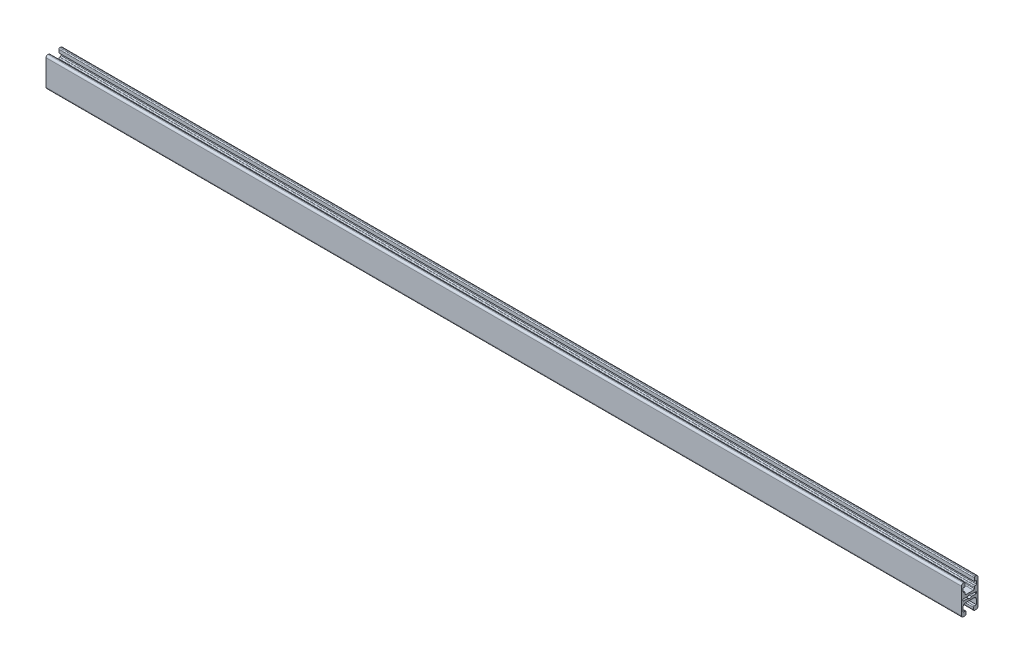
from build123d import *

# Parameters (mm, degrees)
STRUKTURBAUTEIL1_DEPTH = 1000


with BuildPart() as part:
    # Model2 → Strukturbauteil1 (new body)
    with BuildSketch(Plane(origin=(0, 0, 0), x_dir=(0, 0, -1), z_dir=(1, 0, 0))):
        with BuildLine():
            Line((-9, -14), (-9, 14))
            ThreePointArc((-9, 14), (-8.414213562, 15.414213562), (-7, 16))
            Line((-7, 16), (-6, 16))
            ThreePointArc((-6, 16), (-5.292893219, 15.707106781), (-5, 15))
            Line((-5, 15), (-5, 11.5))
            Line((-5, 11.5), (-7.175, 11.5))
            Line((-7.175, 11.5), (-7.175, 8))
            ThreePointArc((-7.175, 8), (-6.882106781, 7.292893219), (-6.175, 7))
            Line((-6.175, 7), (-6, 7))
            ThreePointArc((-6, 7), (-5.292893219, 6.707106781), (-5, 6))
            Line((-5, 6), (-5, 4.75))
            ThreePointArc((-5, 4.75), (-4.707106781, 4.042893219), (-4, 3.75))
            Line((-4, 3.75), (4, 3.75))
            ThreePointArc((4, 3.75), (4.707106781, 4.042893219), (5, 4.75))
            Line((5, 4.75), (5, 6))
            ThreePointArc((5, 6), (5.292893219, 6.707106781), (6, 7))
            Line((6, 7), (6.175, 7))
            ThreePointArc((6.175, 7), (6.882106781, 7.292893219), (7.175, 8))
            Line((7.175, 8), (7.175, 11.5))
            Line((7.175, 11.5), (5, 11.5))
            Line((5, 11.5), (5, 15))
            ThreePointArc((5, 15), (5.292893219, 15.707106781), (6, 16))
            Line((6, 16), (7, 16))
            ThreePointArc((7, 16), (8.414213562, 15.414213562), (9, 14))
            Line((9, 14), (9, -14))
            ThreePointArc((9, -14), (8.414213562, -15.414213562), (7, -16))
            Line((7, -16), (5.5, -16))
            ThreePointArc((5.5, -16), (4.439339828, -15.560660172), (4, -14.5))
            Line((4, -14.5), (4, -12.5))
            ThreePointArc((4, -12.5), (4.292893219, -11.792893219), (5, -11.5))
            Line((5, -11.5), (7.175, -11.5))
            Line((7.175, -11.5), (7.175, -6.25))
            ThreePointArc((7.175, -6.25), (6.442766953, -4.482233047), (4.675, -3.75))
            Line((4.675, -3.75), (-4.675, -3.75))
            ThreePointArc((-4.675, -3.75), (-6.442766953, -4.482233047), (-7.175, -6.25))
            Line((-7.175, -6.25), (-7.175, -11.5))
            Line((-7.175, -11.5), (-5, -11.5))
            ThreePointArc((-5, -11.5), (-4.292893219, -11.792893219), (-4, -12.5))
            Line((-4, -12.5), (-4, -14.5))
            ThreePointArc((-4, -14.5), (-4.439339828, -15.560660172), (-5.5, -16))
            Line((-5.5, -16), (-7, -16))
            ThreePointArc((-7, -16), (-8.414213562, -15.414213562), (-9, -14))
        make_face()
        with BuildLine():
            Line((-1.846618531, -1), (-7.175, -1))
            Line((-7.175, -1), (-7.175, 1))
            Line((-7.175, 1), (-1.846618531, 1))
            ThreePointArc((-1.846618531, 1), (0, 2.1), (1.846618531, 1))
            Line((1.846618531, 1), (7.175, 1))
            Line((7.175, 1), (7.175, -1))
            Line((7.175, -1), (1.846618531, -1))
            ThreePointArc((1.846618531, -1), (0, -2.1), (-1.846618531, -1))
        make_face(mode=Mode.SUBTRACT)
    extrude(amount=STRUKTURBAUTEIL1_DEPTH)


solid = part.part
